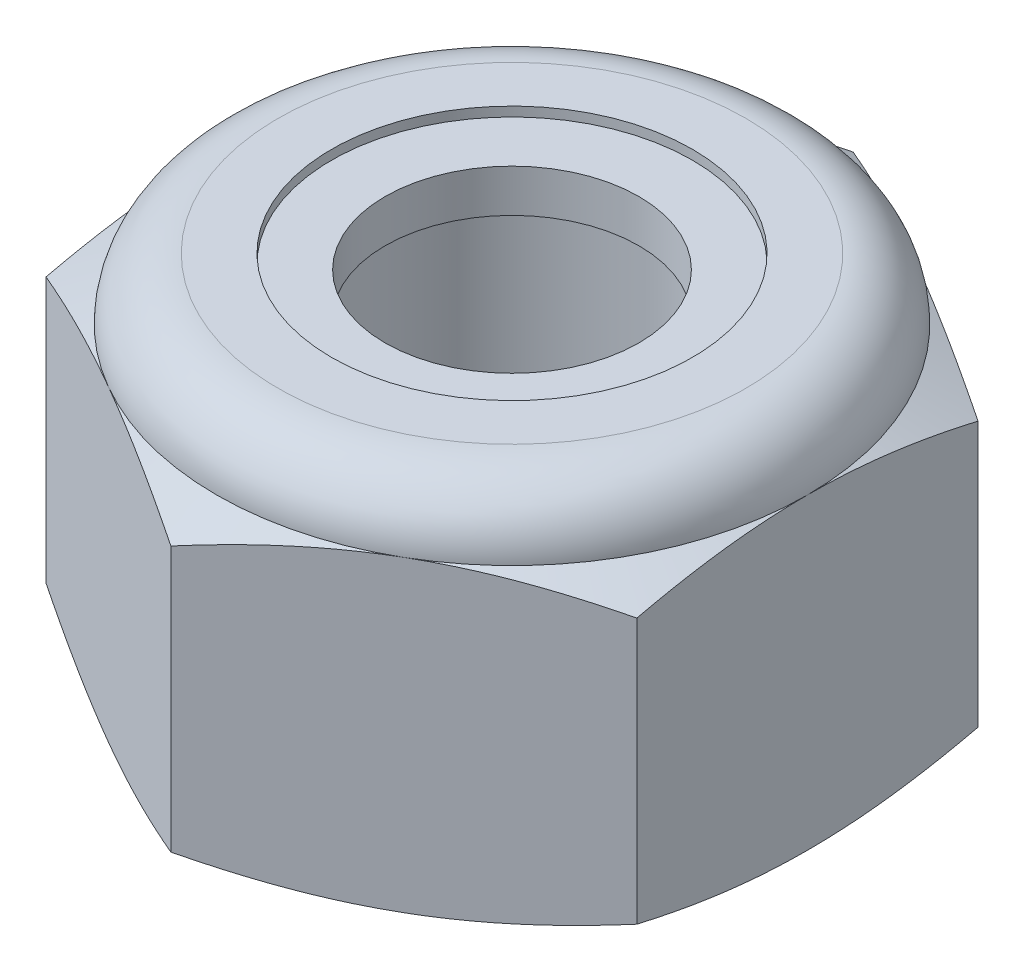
from build123d import *

# Parameters (mm, degrees)
EXTRUDE1_DEPTH = 5.953125
SKETCH2_W      = 2.413
SKETCH2_H      = 5.953125


with BuildPart() as part:
    # Sketch1 → Extrude1 (new body)
    with BuildSketch(Plane(origin=(0, 0, 0), x_dir=(1, 0, 0), z_dir=(0, 1, 0))):
        Polygon((0, 5.499261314), (-4.7625, 2.749630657), (-4.7625, -2.749630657), (0, -5.499261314), (4.7625, -2.749630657), (4.7625, 2.749630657), align=None)
    extrude(amount=EXTRUDE1_DEPTH)

    # Sketch4 → Cut-Revolve2 (revolve, cut)
    with BuildSketch(Plane(origin=(0, 0, 0), x_dir=(0, 0, -1), z_dir=(1, 0, 0))):
        Polygon((0, 5.953125), (2.413, 5.953125), (2.045424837, 5.781721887), (2.045424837, 0.171403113), (2.413, 0), (0, 0), align=None)
    revolve(axis=Axis((0, 5.953125, 0), (0, 1, 0)), mode=Mode.SUBTRACT)


with BuildPart() as body_2:
    # Sketch2 → Revolve1 (revolve)
    with BuildSketch(Plane(origin=(0, 0, 0), x_dir=(0, 0, -1), z_dir=(1, 0, 0))):
        with Locations((1.2065, 2.9765625)):
            Rectangle(SKETCH2_W, SKETCH2_H)
    revolve(axis=Axis((0, -2.413, 0), (0, 1, 0)))


with BuildPart() as part_1:
    add(part.part)

    # Combine1: cut body 2
    add(body_2.part, mode=Mode.SUBTRACT)

    # Sketch5 → Cut-Revolve3 (revolve, cut)
    with BuildSketch(Plane(origin=(0, 0, 0), x_dir=(0, 0, -1), z_dir=(1, 0, 0))):
        with BuildLine():
            Line((0, 0), (4.7625, 0))
            Line((4.7625, 0), (5.499261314, 0.343557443))
            Line((5.499261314, 0.343557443), (5.499261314, 4.617380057))
            Line((5.499261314, 4.617380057), (4.7625, 4.9609375))
            ThreePointArc((4.7625, 4.9609375), (4.471895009, 5.662520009), (3.7703125, 5.953125))
            Line((3.7703125, 5.953125), (3.7703125, 7.223125))
            Line((3.7703125, 7.223125), (6.769261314, 7.223125))
            Line((6.769261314, 7.223125), (6.769261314, -1.27))
            Line((6.769261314, -1.27), (0, -1.27))
            Line((0, -1.27), (0, 0))
        make_face()
    revolve(axis=Axis((0, 0, 0), (0, 1, 0)), mode=Mode.SUBTRACT)

    # Sketch6 → Cut-Revolve4 (revolve, cut)
    with BuildSketch(Plane(origin=(0, 0, 0), x_dir=(0, 0, -1), z_dir=(1, 0, 0))):
        with BuildLine():
            Line((0, 4.9609375), (4.6101, 4.9609375))
            ThreePointArc((4.6101, 4.9609375), (4.364131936, 5.554756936), (3.7703125, 5.800725))
            Line((3.7703125, 5.800725), (2.907868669, 5.800725))
            Line((2.907868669, 5.800725), (2.907868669, 7.223125))
            Line((2.907868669, 7.223125), (0, 7.223125))
            Line((0, 7.223125), (0, 4.9609375))
        make_face()
    revolve(axis=Axis((0, 7.223125, 0), (0, 1, 0)), mode=Mode.SUBTRACT)


with BuildPart() as body_2_2:
    # Sketch7 → Revolve2 (revolve)
    with BuildSketch(Plane(origin=(0, 0, 0), x_dir=(0, 0, -1), z_dir=(1, 0, 0))):
        with BuildLine():
            Line((2.045424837, 5.0371375), (4.530088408, 5.0371375))
            ThreePointArc((4.530088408, 5.0371375), (4.282601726, 5.527175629), (3.7703125, 5.724525))
            Line((3.7703125, 5.724525), (2.045424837, 5.724525))
            Line((2.045424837, 5.724525), (2.045424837, 5.0371375))
        make_face()
    revolve(axis=Axis((0, 5.0371375, 0), (0, 1, 0)))


solid = Compound([part_1.part, body_2_2.part])
